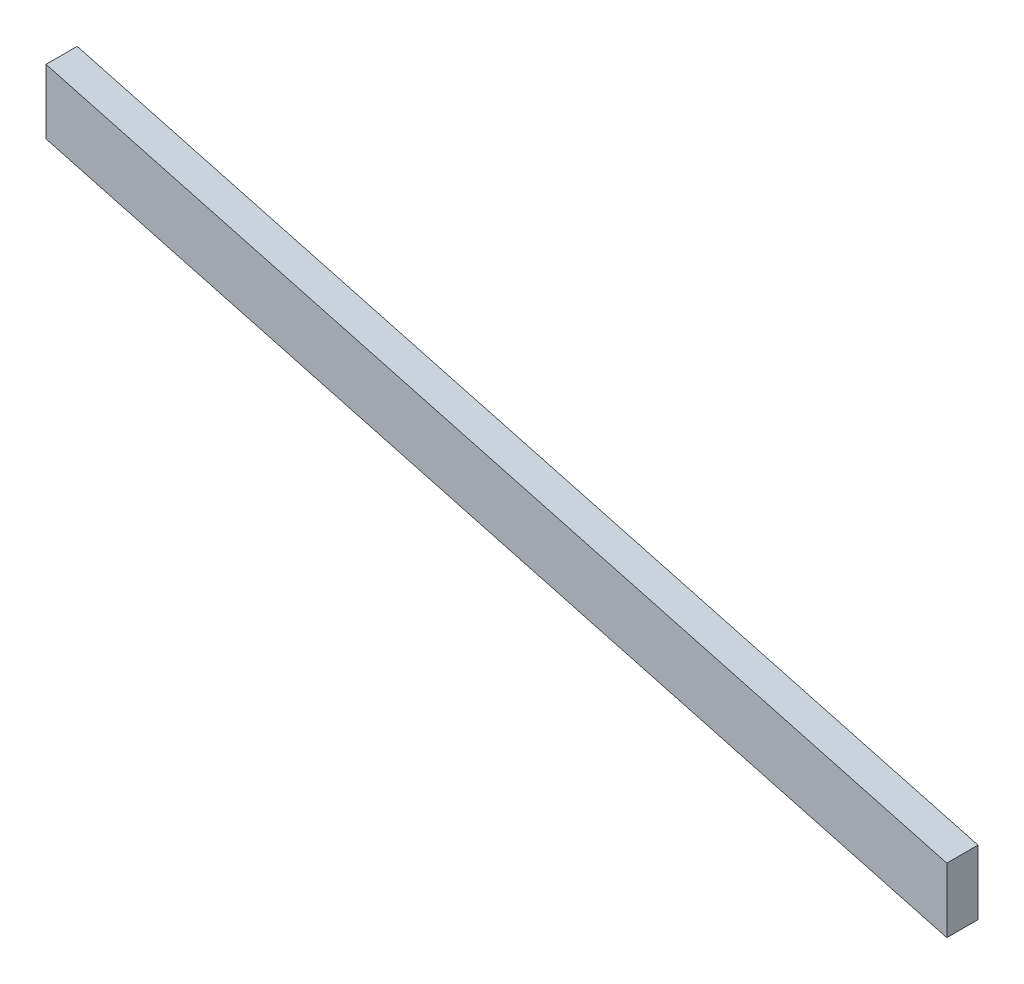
ISO-10303-21;
HEADER;
FILE_DESCRIPTION(('STEP AP214'),'2;1');
FILE_NAME('part.step','',(''),(''),'','','');
FILE_SCHEMA(('AUTOMOTIVE_DESIGN { 1 0 10303 214 1 1 1 1 }'));
ENDSEC;
DATA;
#1=APPLICATION_CONTEXT('core data for automotive mechanical design processes');
#2=APPLICATION_PROTOCOL_DEFINITION('international standard','automotive_design',2000,#1);
#3=PRODUCT_CONTEXT('',#1,'mechanical');
#4=PRODUCT('Part','Part','',(#3));
#5=PRODUCT_RELATED_PRODUCT_CATEGORY('part','',(#4));
#6=PRODUCT_DEFINITION_FORMATION('','',#4);
#7=PRODUCT_DEFINITION_CONTEXT('part definition',#1,'design');
#8=PRODUCT_DEFINITION('design','',#6,#7);
#9=PRODUCT_DEFINITION_SHAPE('','',#8);
#10=(LENGTH_UNIT() NAMED_UNIT(*) SI_UNIT(.MILLI.,.METRE.));
#11=(NAMED_UNIT(*) PLANE_ANGLE_UNIT() SI_UNIT($,.RADIAN.));
#12=(NAMED_UNIT(*) SI_UNIT($,.STERADIAN.) SOLID_ANGLE_UNIT());
#13=UNCERTAINTY_MEASURE_WITH_UNIT(LENGTH_MEASURE(1.E-05),#10,'distance_accuracy_value','');
#14=(GEOMETRIC_REPRESENTATION_CONTEXT(3) GLOBAL_UNCERTAINTY_ASSIGNED_CONTEXT((#13)) GLOBAL_UNIT_ASSIGNED_CONTEXT((#10,
#11,#12)) REPRESENTATION_CONTEXT('',''));
#15=CARTESIAN_POINT('',(0.,0.,0.));
#16=DIRECTION('',(0.,0.,1.));
#17=DIRECTION('',(1.,0.,0.));
#18=AXIS2_PLACEMENT_3D('',#15,#16,#17);
#19=CARTESIAN_POINT('',(2499.88097263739,3323.5845112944,40.));
#20=DIRECTION('',(0.258819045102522,0.965925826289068,0.));
#21=DIRECTION('',(-0.965925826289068,0.258819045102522,0.));
#22=AXIS2_PLACEMENT_3D('',#19,#20,#21);
#23=PLANE('',#22);
#24=DIRECTION('',(0.965925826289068,-0.258819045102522,0.));
#25=VECTOR('',#24,1.);
#26=CARTESIAN_POINT('',(2499.88097263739,3323.5845112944,0.));
#27=LINE('',#26,#25);
#28=CARTESIAN_POINT('',(2499.88097263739,3323.5845112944,0.));
#29=VERTEX_POINT('',#28);
#30=CARTESIAN_POINT('',(3655.67310544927,3013.89094268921,0.));
#31=VERTEX_POINT('',#30);
#32=EDGE_CURVE('E68',#29,#31,#27,.T.);
#33=ORIENTED_EDGE('',*,*,#32,.T.);
#34=DIRECTION('',(0.,0.,-1.));
#35=VECTOR('',#34,1.);
#36=CARTESIAN_POINT('',(3655.67310544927,3013.89094268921,40.));
#37=LINE('',#36,#35);
#38=CARTESIAN_POINT('',(3655.67310544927,3013.89094268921,40.));
#39=VERTEX_POINT('',#38);
#40=EDGE_CURVE('E11',#39,#31,#37,.T.);
#41=ORIENTED_EDGE('',*,*,#40,.F.);
#42=DIRECTION('',(0.965925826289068,-0.258819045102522,0.));
#43=VECTOR('',#42,1.);
#44=CARTESIAN_POINT('',(2499.88097263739,3323.5845112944,40.));
#45=LINE('',#44,#43);
#46=CARTESIAN_POINT('',(2499.88097263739,3323.5845112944,40.));
#47=VERTEX_POINT('',#46);
#48=EDGE_CURVE('E86',#47,#39,#45,.T.);
#49=ORIENTED_EDGE('',*,*,#48,.F.);
#50=DIRECTION('',(0.,0.,-1.));
#51=VECTOR('',#50,1.);
#52=CARTESIAN_POINT('',(2499.88097263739,3323.5845112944,40.));
#53=LINE('',#52,#51);
#54=EDGE_CURVE('E80',#47,#29,#53,.T.);
#55=ORIENTED_EDGE('',*,*,#54,.T.);
#56=EDGE_LOOP('',(#33,#41,#49,#55));
#57=FACE_BOUND('',#56,.T.);
#58=ADVANCED_FACE('F24',(#57),#23,.F.);
#59=CARTESIAN_POINT('',(3655.67310544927,3013.89094268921,40.));
#60=DIRECTION('',(-1.,0.,0.));
#61=DIRECTION('',(0.,-1.,0.));
#62=AXIS2_PLACEMENT_3D('',#59,#60,#61);
#63=PLANE('',#62);
#64=DIRECTION('',(0.,1.,0.));
#65=VECTOR('',#64,1.);
#66=CARTESIAN_POINT('',(3655.67310544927,3013.89094268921,0.));
#67=LINE('',#66,#65);
#68=CARTESIAN_POINT('',(3655.67310544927,3096.71303712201,0.));
#69=VERTEX_POINT('',#68);
#70=EDGE_CURVE('E64',#31,#69,#67,.T.);
#71=ORIENTED_EDGE('',*,*,#70,.T.);
#72=DIRECTION('',(0.,0.,-1.));
#73=VECTOR('',#72,1.);
#74=CARTESIAN_POINT('',(3655.67310544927,3096.71303712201,40.));
#75=LINE('',#74,#73);
#76=CARTESIAN_POINT('',(3655.67310544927,3096.71303712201,40.));
#77=VERTEX_POINT('',#76);
#78=EDGE_CURVE('E31',#77,#69,#75,.T.);
#79=ORIENTED_EDGE('',*,*,#78,.F.);
#80=DIRECTION('',(0.,1.,0.));
#81=VECTOR('',#80,1.);
#82=CARTESIAN_POINT('',(3655.67310544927,3013.89094268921,40.));
#83=LINE('',#82,#81);
#84=EDGE_CURVE('E76',#39,#77,#83,.T.);
#85=ORIENTED_EDGE('',*,*,#84,.F.);
#86=ORIENTED_EDGE('',*,*,#40,.T.);
#87=EDGE_LOOP('',(#71,#79,#85,#86));
#88=FACE_BOUND('',#87,.T.);
#89=ADVANCED_FACE('F75',(#88),#63,.F.);
#90=CARTESIAN_POINT('',(3655.67310544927,3096.71303712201,40.));
#91=DIRECTION('',(-0.258819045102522,-0.965925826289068,0.));
#92=DIRECTION('',(0.965925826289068,-0.258819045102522,0.));
#93=AXIS2_PLACEMENT_3D('',#90,#91,#92);
#94=PLANE('',#93);
#95=DIRECTION('',(-0.965925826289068,0.258819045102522,0.));
#96=VECTOR('',#95,1.);
#97=CARTESIAN_POINT('',(3655.67310544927,3096.71303712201,0.));
#98=LINE('',#97,#96);
#99=CARTESIAN_POINT('',(2499.88097263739,3406.4066057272,0.));
#100=VERTEX_POINT('',#99);
#101=EDGE_CURVE('E69',#69,#100,#98,.T.);
#102=ORIENTED_EDGE('',*,*,#101,.T.);
#103=DIRECTION('',(0.,0.,-1.));
#104=VECTOR('',#103,1.);
#105=CARTESIAN_POINT('',(2499.88097263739,3406.4066057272,40.));
#106=LINE('',#105,#104);
#107=CARTESIAN_POINT('',(2499.88097263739,3406.4066057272,40.));
#108=VERTEX_POINT('',#107);
#109=EDGE_CURVE('E92',#108,#100,#106,.T.);
#110=ORIENTED_EDGE('',*,*,#109,.F.);
#111=DIRECTION('',(-0.965925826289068,0.258819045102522,0.));
#112=VECTOR('',#111,1.);
#113=CARTESIAN_POINT('',(3655.67310544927,3096.71303712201,40.));
#114=LINE('',#113,#112);
#115=EDGE_CURVE('E43',#77,#108,#114,.T.);
#116=ORIENTED_EDGE('',*,*,#115,.F.);
#117=ORIENTED_EDGE('',*,*,#78,.T.);
#118=EDGE_LOOP('',(#102,#110,#116,#117));
#119=FACE_BOUND('',#118,.T.);
#120=ADVANCED_FACE('F95',(#119),#94,.F.);
#121=CARTESIAN_POINT('',(2499.88097263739,3406.4066057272,40.));
#122=DIRECTION('',(1.,0.,0.));
#123=DIRECTION('',(0.,1.,0.));
#124=AXIS2_PLACEMENT_3D('',#121,#122,#123);
#125=PLANE('',#124);
#126=DIRECTION('',(0.,-1.,0.));
#127=VECTOR('',#126,1.);
#128=CARTESIAN_POINT('',(2499.88097263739,3406.4066057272,0.));
#129=LINE('',#128,#127);
#130=EDGE_CURVE('E84',#100,#29,#129,.T.);
#131=ORIENTED_EDGE('',*,*,#130,.T.);
#132=ORIENTED_EDGE('',*,*,#54,.F.);
#133=DIRECTION('',(0.,-1.,0.));
#134=VECTOR('',#133,1.);
#135=CARTESIAN_POINT('',(2499.88097263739,3406.4066057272,40.));
#136=LINE('',#135,#134);
#137=EDGE_CURVE('E38',#108,#47,#136,.T.);
#138=ORIENTED_EDGE('',*,*,#137,.F.);
#139=ORIENTED_EDGE('',*,*,#109,.T.);
#140=EDGE_LOOP('',(#131,#132,#138,#139));
#141=FACE_BOUND('',#140,.T.);
#142=ADVANCED_FACE('F97',(#141),#125,.F.);
#143=CARTESIAN_POINT('',(2499.88097263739,3323.5845112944,40.));
#144=DIRECTION('',(0.,0.,-1.));
#145=DIRECTION('',(-1.,0.,0.));
#146=AXIS2_PLACEMENT_3D('',#143,#144,#145);
#147=PLANE('',#146);
#148=ORIENTED_EDGE('',*,*,#48,.T.);
#149=ORIENTED_EDGE('',*,*,#84,.T.);
#150=ORIENTED_EDGE('',*,*,#115,.T.);
#151=ORIENTED_EDGE('',*,*,#137,.T.);
#152=EDGE_LOOP('',(#148,#149,#150,#151));
#153=FACE_BOUND('',#152,.T.);
#154=ADVANCED_FACE('F98',(#153),#147,.F.);
#155=CARTESIAN_POINT('',(2499.88097263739,3323.5845112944,0.));
#156=DIRECTION('',(0.,0.,-1.));
#157=DIRECTION('',(-1.,0.,0.));
#158=AXIS2_PLACEMENT_3D('',#155,#156,#157);
#159=PLANE('',#158);
#160=ORIENTED_EDGE('',*,*,#32,.F.);
#161=ORIENTED_EDGE('',*,*,#130,.F.);
#162=ORIENTED_EDGE('',*,*,#101,.F.);
#163=ORIENTED_EDGE('',*,*,#70,.F.);
#164=EDGE_LOOP('',(#160,#161,#162,#163));
#165=FACE_BOUND('',#164,.T.);
#166=ADVANCED_FACE('F65',(#165),#159,.T.);
#167=CLOSED_SHELL('',(#58,#89,#120,#142,#154,#166));
#168=MANIFOLD_SOLID_BREP('B2',#167);
#169=ADVANCED_BREP_SHAPE_REPRESENTATION('',(#18,#168),#14);
#170=SHAPE_DEFINITION_REPRESENTATION(#9,#169);
ENDSEC;
END-ISO-10303-21;
